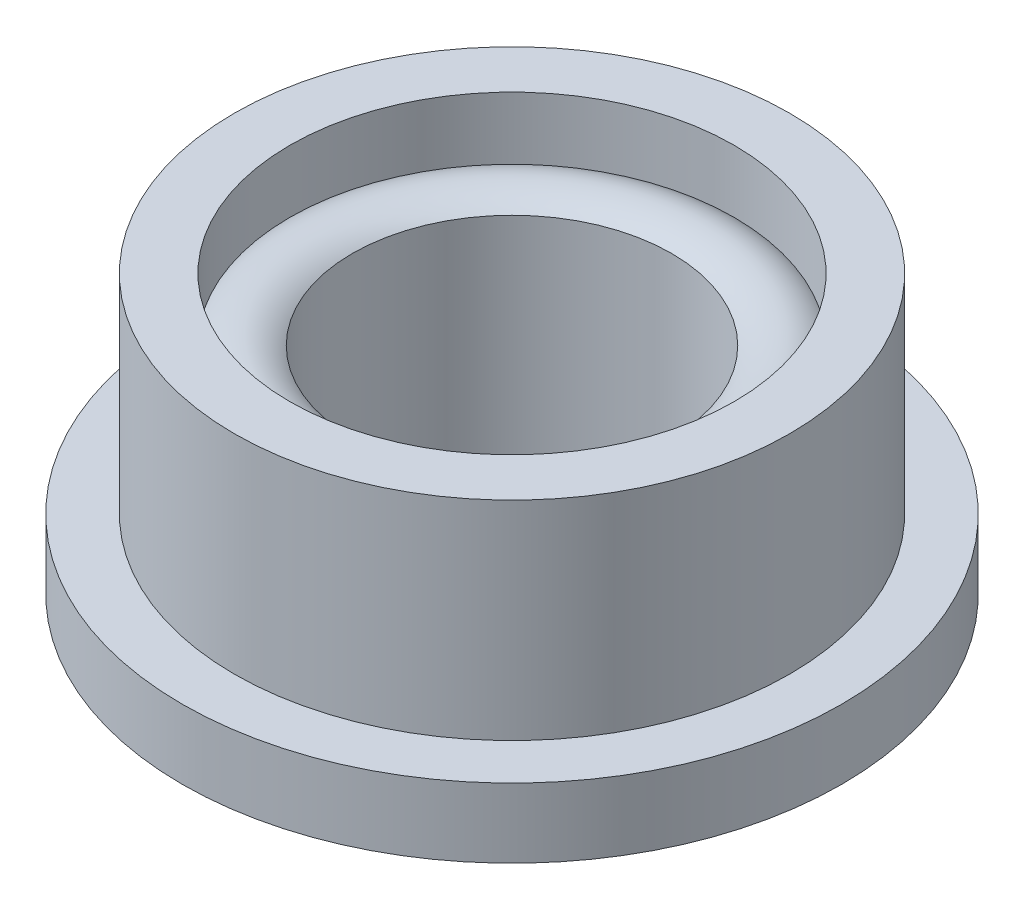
ISO-10303-21;
HEADER;
FILE_DESCRIPTION(('STEP AP214'),'2;1');
FILE_NAME('part.step','',(''),(''),'','','');
FILE_SCHEMA(('AUTOMOTIVE_DESIGN { 1 0 10303 214 1 1 1 1 }'));
ENDSEC;
DATA;
#1=APPLICATION_CONTEXT('core data for automotive mechanical design processes');
#2=APPLICATION_PROTOCOL_DEFINITION('international standard','automotive_design',2000,#1);
#3=PRODUCT_CONTEXT('',#1,'mechanical');
#4=PRODUCT('Part','Part','',(#3));
#5=PRODUCT_RELATED_PRODUCT_CATEGORY('part','',(#4));
#6=PRODUCT_DEFINITION_FORMATION('','',#4);
#7=PRODUCT_DEFINITION_CONTEXT('part definition',#1,'design');
#8=PRODUCT_DEFINITION('design','',#6,#7);
#9=PRODUCT_DEFINITION_SHAPE('','',#8);
#10=(LENGTH_UNIT() NAMED_UNIT(*) SI_UNIT(.MILLI.,.METRE.));
#11=(NAMED_UNIT(*) PLANE_ANGLE_UNIT() SI_UNIT($,.RADIAN.));
#12=(NAMED_UNIT(*) SI_UNIT($,.STERADIAN.) SOLID_ANGLE_UNIT());
#13=UNCERTAINTY_MEASURE_WITH_UNIT(LENGTH_MEASURE(1.E-05),#10,'distance_accuracy_value','');
#14=(GEOMETRIC_REPRESENTATION_CONTEXT(3) GLOBAL_UNCERTAINTY_ASSIGNED_CONTEXT((#13)) GLOBAL_UNIT_ASSIGNED_CONTEXT((#10,
#11,#12)) REPRESENTATION_CONTEXT('',''));
#15=CARTESIAN_POINT('',(0.,0.,0.));
#16=DIRECTION('',(0.,0.,1.));
#17=DIRECTION('',(1.,0.,0.));
#18=AXIS2_PLACEMENT_3D('',#15,#16,#17);
#19=CARTESIAN_POINT('',(0.,1.,0.));
#20=DIRECTION('',(0.,1.,0.));
#21=DIRECTION('',(0.,0.,1.));
#22=AXIS2_PLACEMENT_3D('',#19,#20,#21);
#23=PLANE('',#22);
#24=CARTESIAN_POINT('',(0.,1.,0.));
#25=DIRECTION('',(0.,1.,0.));
#26=DIRECTION('',(0.,0.,1.));
#27=AXIS2_PLACEMENT_3D('',#24,#25,#26);
#28=CIRCLE('',#27,4.75);
#29=CARTESIAN_POINT('',(0.,1.,4.75));
#30=VERTEX_POINT('',#29);
#31=EDGE_CURVE('E10',#30,#30,#28,.T.);
#32=ORIENTED_EDGE('',*,*,#31,.T.);
#33=EDGE_LOOP('',(#32));
#34=FACE_BOUND('',#33,.T.);
#35=CARTESIAN_POINT('',(0.,1.,0.));
#36=DIRECTION('',(0.,1.,0.));
#37=DIRECTION('',(0.,0.,1.));
#38=AXIS2_PLACEMENT_3D('',#35,#36,#37);
#39=CIRCLE('',#38,4.);
#40=CARTESIAN_POINT('',(0.,1.,4.));
#41=VERTEX_POINT('',#40);
#42=EDGE_CURVE('E49',#41,#41,#39,.T.);
#43=ORIENTED_EDGE('',*,*,#42,.F.);
#44=EDGE_LOOP('',(#43));
#45=FACE_BOUND('',#44,.T.);
#46=ADVANCED_FACE('F36',(#34,#45),#23,.T.);
#47=CARTESIAN_POINT('',(0.,0.,0.));
#48=DIRECTION('',(0.,1.,0.));
#49=DIRECTION('',(0.,0.,1.));
#50=AXIS2_PLACEMENT_3D('',#47,#48,#49);
#51=PLANE('',#50);
#52=CARTESIAN_POINT('',(0.,0.,0.));
#53=DIRECTION('',(0.,1.,0.));
#54=DIRECTION('',(0.,0.,1.));
#55=AXIS2_PLACEMENT_3D('',#52,#53,#54);
#56=CIRCLE('',#55,2.3);
#57=CARTESIAN_POINT('',(0.,0.,2.3));
#58=VERTEX_POINT('',#57);
#59=EDGE_CURVE('E58',#58,#58,#56,.T.);
#60=ORIENTED_EDGE('',*,*,#59,.T.);
#61=EDGE_LOOP('',(#60));
#62=FACE_BOUND('',#61,.T.);
#63=CARTESIAN_POINT('',(0.,0.,0.));
#64=DIRECTION('',(0.,1.,0.));
#65=DIRECTION('',(0.,0.,1.));
#66=AXIS2_PLACEMENT_3D('',#63,#64,#65);
#67=CIRCLE('',#66,4.75);
#68=CARTESIAN_POINT('',(0.,0.,4.75));
#69=VERTEX_POINT('',#68);
#70=EDGE_CURVE('E40',#69,#69,#67,.T.);
#71=ORIENTED_EDGE('',*,*,#70,.F.);
#72=EDGE_LOOP('',(#71));
#73=FACE_BOUND('',#72,.T.);
#74=ADVANCED_FACE('F76',(#62,#73),#51,.F.);
#75=CARTESIAN_POINT('',(0.,1.,0.));
#76=DIRECTION('',(0.,-1.,0.));
#77=DIRECTION('',(0.,0.,-1.));
#78=AXIS2_PLACEMENT_3D('',#75,#76,#77);
#79=CYLINDRICAL_SURFACE('',#78,4.75);
#80=ORIENTED_EDGE('',*,*,#31,.F.);
#81=EDGE_LOOP('',(#80));
#82=FACE_BOUND('',#81,.T.);
#83=ORIENTED_EDGE('',*,*,#70,.T.);
#84=EDGE_LOOP('',(#83));
#85=FACE_BOUND('',#84,.T.);
#86=ADVANCED_FACE('F38',(#82,#85),#79,.T.);
#87=CARTESIAN_POINT('',(0.,4.,0.));
#88=DIRECTION('',(0.,1.,0.));
#89=DIRECTION('',(0.,0.,1.));
#90=AXIS2_PLACEMENT_3D('',#87,#88,#89);
#91=PLANE('',#90);
#92=CARTESIAN_POINT('',(0.,4.,0.));
#93=DIRECTION('',(0.,1.,0.));
#94=DIRECTION('',(0.,0.,1.));
#95=AXIS2_PLACEMENT_3D('',#92,#93,#94);
#96=CIRCLE('',#95,3.2);
#97=CARTESIAN_POINT('',(0.,4.,3.2));
#98=VERTEX_POINT('',#97);
#99=EDGE_CURVE('E55',#98,#98,#96,.T.);
#100=ORIENTED_EDGE('',*,*,#99,.F.);
#101=EDGE_LOOP('',(#100));
#102=FACE_BOUND('',#101,.T.);
#103=CARTESIAN_POINT('',(0.,4.,0.));
#104=DIRECTION('',(0.,1.,0.));
#105=DIRECTION('',(0.,0.,1.));
#106=AXIS2_PLACEMENT_3D('',#103,#104,#105);
#107=CIRCLE('',#106,4.);
#108=CARTESIAN_POINT('',(0.,4.,4.));
#109=VERTEX_POINT('',#108);
#110=EDGE_CURVE('E47',#109,#109,#107,.T.);
#111=ORIENTED_EDGE('',*,*,#110,.T.);
#112=EDGE_LOOP('',(#111));
#113=FACE_BOUND('',#112,.T.);
#114=ADVANCED_FACE('F82',(#102,#113),#91,.T.);
#115=CARTESIAN_POINT('',(0.,4.,0.));
#116=DIRECTION('',(0.,-1.,0.));
#117=DIRECTION('',(0.,0.,-1.));
#118=AXIS2_PLACEMENT_3D('',#115,#116,#117);
#119=CYLINDRICAL_SURFACE('',#118,4.);
#120=ORIENTED_EDGE('',*,*,#110,.F.);
#121=EDGE_LOOP('',(#120));
#122=FACE_BOUND('',#121,.T.);
#123=ORIENTED_EDGE('',*,*,#42,.T.);
#124=EDGE_LOOP('',(#123));
#125=FACE_BOUND('',#124,.T.);
#126=ADVANCED_FACE('F87',(#122,#125),#119,.T.);
#127=CARTESIAN_POINT('',(0.,3.1,0.));
#128=DIRECTION('',(0.,1.,0.));
#129=DIRECTION('',(0.,0.,1.));
#130=AXIS2_PLACEMENT_3D('',#127,#128,#129);
#131=CYLINDRICAL_SURFACE('',#130,3.2);
#132=CARTESIAN_POINT('',(0.,3.1,0.));
#133=DIRECTION('',(0.,1.,0.));
#134=DIRECTION('',(0.,0.,1.));
#135=AXIS2_PLACEMENT_3D('',#132,#133,#134);
#136=CIRCLE('',#135,3.2);
#137=CARTESIAN_POINT('',(0.,3.1,3.2));
#138=VERTEX_POINT('',#137);
#139=EDGE_CURVE('E52',#138,#138,#136,.T.);
#140=ORIENTED_EDGE('',*,*,#139,.F.);
#141=EDGE_LOOP('',(#140));
#142=FACE_BOUND('',#141,.T.);
#143=ORIENTED_EDGE('',*,*,#99,.T.);
#144=EDGE_LOOP('',(#143));
#145=FACE_BOUND('',#144,.T.);
#146=ADVANCED_FACE('F97',(#142,#145),#131,.F.);
#147=CARTESIAN_POINT('',(0.,2.5,0.));
#148=DIRECTION('',(0.,1.,0.));
#149=DIRECTION('',(0.,0.,1.));
#150=AXIS2_PLACEMENT_3D('',#147,#148,#149);
#151=TOROIDAL_SURFACE('',#150,2.75,0.750000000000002);
#152=CARTESIAN_POINT('',(0.,3.1,0.));
#153=DIRECTION('',(0.,-1.,0.));
#154=DIRECTION('',(0.,0.,-1.));
#155=AXIS2_PLACEMENT_3D('',#152,#153,#154);
#156=CIRCLE('',#155,2.3);
#157=CARTESIAN_POINT('',(0.,3.1,-2.3));
#158=VERTEX_POINT('',#157);
#159=EDGE_CURVE('E63',#158,#158,#156,.T.);
#160=ORIENTED_EDGE('',*,*,#159,.T.);
#161=EDGE_LOOP('',(#160));
#162=FACE_BOUND('',#161,.T.);
#163=ORIENTED_EDGE('',*,*,#139,.T.);
#164=EDGE_LOOP('',(#163));
#165=FACE_BOUND('',#164,.T.);
#166=ADVANCED_FACE('F67',(#162,#165),#151,.T.);
#167=CARTESIAN_POINT('',(0.,-6.,0.));
#168=DIRECTION('',(0.,1.,0.));
#169=DIRECTION('',(0.,0.,1.));
#170=AXIS2_PLACEMENT_3D('',#167,#168,#169);
#171=CYLINDRICAL_SURFACE('',#170,2.3);
#172=ORIENTED_EDGE('',*,*,#159,.F.);
#173=EDGE_LOOP('',(#172));
#174=FACE_BOUND('',#173,.T.);
#175=ORIENTED_EDGE('',*,*,#59,.F.);
#176=EDGE_LOOP('',(#175));
#177=FACE_BOUND('',#176,.T.);
#178=ADVANCED_FACE('F70',(#174,#177),#171,.F.);
#179=CLOSED_SHELL('',(#46,#74,#86,#114,#126,#146,#166,#178));
#180=MANIFOLD_SOLID_BREP('B2',#179);
#181=ADVANCED_BREP_SHAPE_REPRESENTATION('',(#18,#180),#14);
#182=SHAPE_DEFINITION_REPRESENTATION(#9,#181);
ENDSEC;
END-ISO-10303-21;
